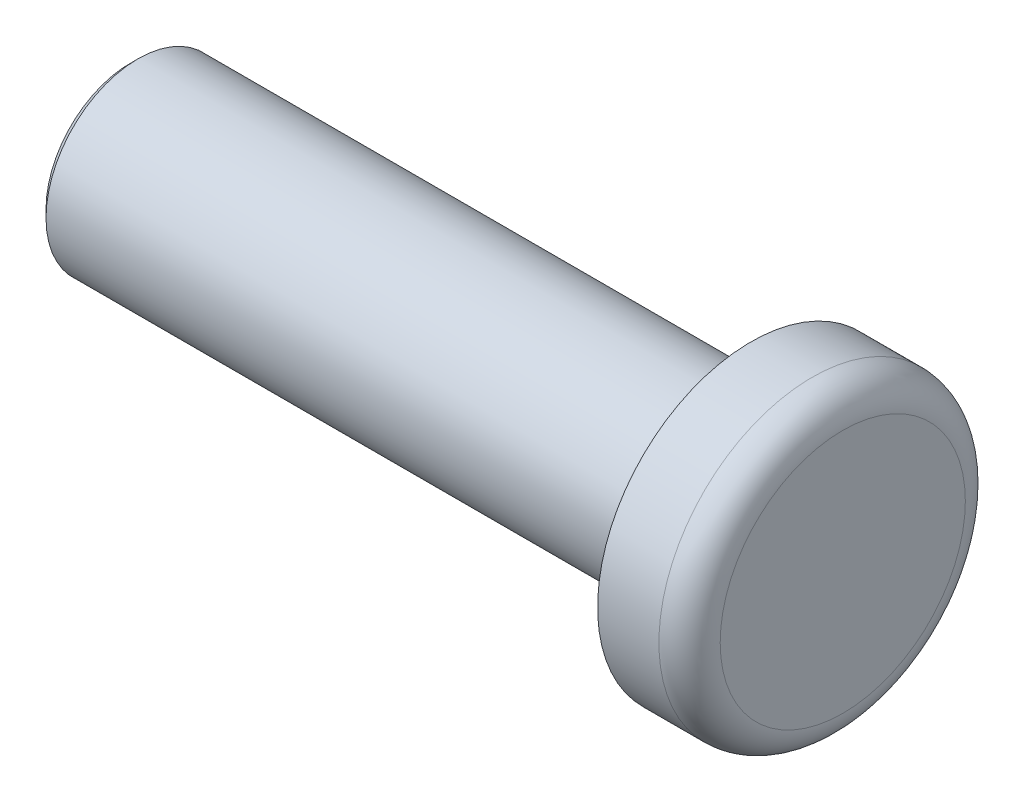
from build123d import *

# Parameters (mm, degrees)
SKETCH_1_R      = 5
EXTRUDE_1_DEPTH = 3
SKETCH_2_R      = 3
EXTRUDE_2_DEPTH = 20.25
FILLET_1_R      = 1
CHAMFER_1_SIZE  = 0.25


with BuildPart() as part:
    # Sketch 1 → Extrude 1 (new body)
    with BuildSketch(Plane(origin=(0, 0, 0), x_dir=(0, 0, -1), z_dir=(1, 0, 0))):
        Circle(SKETCH_1_R)
    extrude(amount=EXTRUDE_1_DEPTH)

    # Sketch 2 → Extrude 2 (add)
    with BuildSketch(Plane.ZY):
        with Locations(Location((0, 0, 0), (0, 0, 180))):
            Circle(SKETCH_2_R)
    extrude(amount=EXTRUDE_2_DEPTH)

    # Fillet 1
    fillet_1_edges = [part.edges().sort_by_distance(p)[0] for p in [
        (3, 0, 5),
    ]]
    fillet(fillet_1_edges, radius=FILLET_1_R)

    # Chamfer 1
    chamfer_1_edges = [part.edges().sort_by_distance(p)[0] for p in [
        (0, 0, 3),
        (-20.25, 0, 3),
    ]]
    chamfer(chamfer_1_edges, length=CHAMFER_1_SIZE)


solid = part.part
